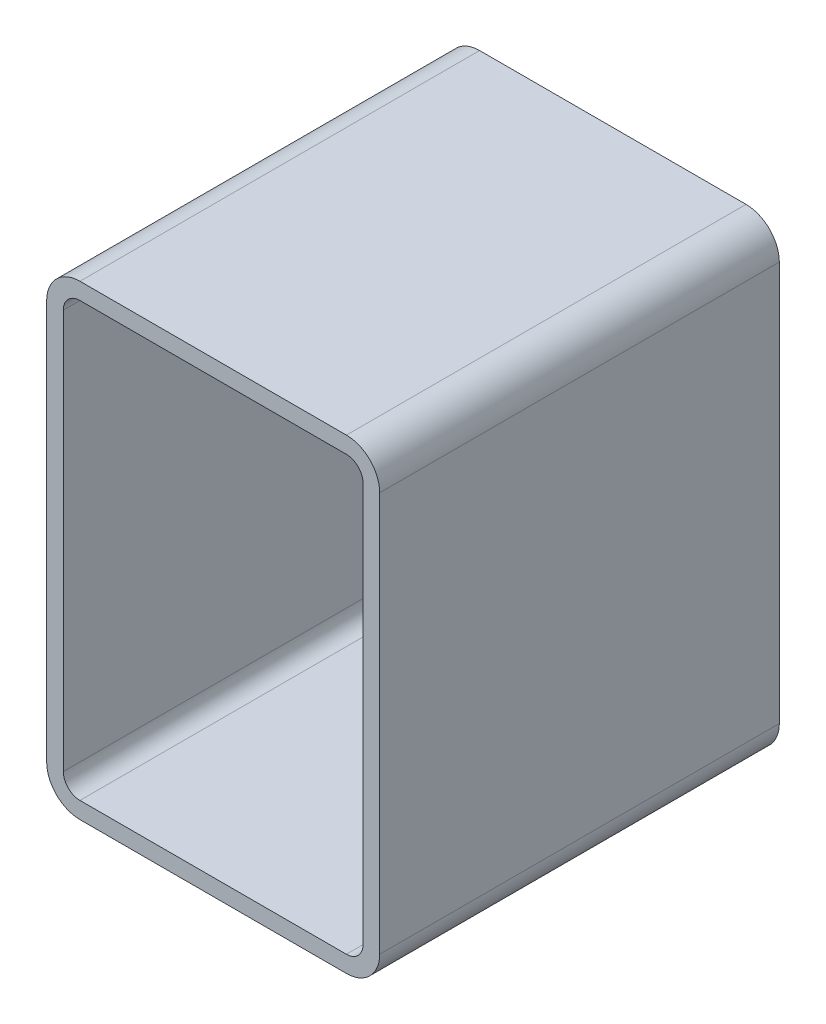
ISO-10303-21;
HEADER;
FILE_DESCRIPTION(('STEP AP214'),'2;1');
FILE_NAME('part.step','',(''),(''),'','','');
FILE_SCHEMA(('AUTOMOTIVE_DESIGN { 1 0 10303 214 1 1 1 1 }'));
ENDSEC;
DATA;
#1=APPLICATION_CONTEXT('core data for automotive mechanical design processes');
#2=APPLICATION_PROTOCOL_DEFINITION('international standard','automotive_design',2000,#1);
#3=PRODUCT_CONTEXT('',#1,'mechanical');
#4=PRODUCT('Part','Part','',(#3));
#5=PRODUCT_RELATED_PRODUCT_CATEGORY('part','',(#4));
#6=PRODUCT_DEFINITION_FORMATION('','',#4);
#7=PRODUCT_DEFINITION_CONTEXT('part definition',#1,'design');
#8=PRODUCT_DEFINITION('design','',#6,#7);
#9=PRODUCT_DEFINITION_SHAPE('','',#8);
#10=(LENGTH_UNIT() NAMED_UNIT(*) SI_UNIT(.MILLI.,.METRE.));
#11=(NAMED_UNIT(*) PLANE_ANGLE_UNIT() SI_UNIT($,.RADIAN.));
#12=(NAMED_UNIT(*) SI_UNIT($,.STERADIAN.) SOLID_ANGLE_UNIT());
#13=UNCERTAINTY_MEASURE_WITH_UNIT(LENGTH_MEASURE(1.E-05),#10,'distance_accuracy_value','');
#14=(GEOMETRIC_REPRESENTATION_CONTEXT(3) GLOBAL_UNCERTAINTY_ASSIGNED_CONTEXT((#13)) GLOBAL_UNIT_ASSIGNED_CONTEXT((#10,
#11,#12)) REPRESENTATION_CONTEXT('',''));
#15=CARTESIAN_POINT('',(0.,0.,0.));
#16=DIRECTION('',(0.,0.,1.));
#17=DIRECTION('',(1.,0.,0.));
#18=AXIS2_PLACEMENT_3D('',#15,#16,#17);
#19=CARTESIAN_POINT('',(28.1345794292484,332.028679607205,304.8));
#20=DIRECTION('',(0.,0.,1.));
#21=DIRECTION('',(1.,0.,0.));
#22=AXIS2_PLACEMENT_3D('',#19,#20,#21);
#23=PLANE('',#22);
#24=CARTESIAN_POINT('',(28.1345794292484,332.028679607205,304.8));
#25=DIRECTION('',(0.,0.,1.));
#26=DIRECTION('',(1.,0.,0.));
#27=AXIS2_PLACEMENT_3D('',#24,#25,#26);
#28=CIRCLE('',#27,25.4);
#29=CARTESIAN_POINT('',(28.1345794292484,357.428679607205,304.8));
#30=VERTEX_POINT('',#29);
#31=CARTESIAN_POINT('',(2.73457942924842,332.028679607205,304.8));
#32=VERTEX_POINT('',#31);
#33=EDGE_CURVE('E211',#30,#32,#28,.T.);
#34=ORIENTED_EDGE('',*,*,#33,.T.);
#35=DIRECTION('',(0.,-1.,0.));
#36=VECTOR('',#35,1.);
#37=CARTESIAN_POINT('',(2.73457942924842,27.2286796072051,304.8));
#38=LINE('',#37,#36);
#39=CARTESIAN_POINT('',(2.73457942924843,27.2286796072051,304.8));
#40=VERTEX_POINT('',#39);
#41=EDGE_CURVE('E214',#32,#40,#38,.T.);
#42=ORIENTED_EDGE('',*,*,#41,.T.);
#43=CARTESIAN_POINT('',(28.1345794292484,27.2286796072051,304.8));
#44=DIRECTION('',(0.,0.,1.));
#45=DIRECTION('',(1.,0.,0.));
#46=AXIS2_PLACEMENT_3D('',#43,#44,#45);
#47=CIRCLE('',#46,25.4);
#48=CARTESIAN_POINT('',(28.1345794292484,1.82867960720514,304.8));
#49=VERTEX_POINT('',#48);
#50=EDGE_CURVE('E217',#40,#49,#47,.T.);
#51=ORIENTED_EDGE('',*,*,#50,.T.);
#52=DIRECTION('',(1.,0.,0.));
#53=VECTOR('',#52,1.);
#54=CARTESIAN_POINT('',(231.334579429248,1.82867960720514,304.8));
#55=LINE('',#54,#53);
#56=CARTESIAN_POINT('',(231.334579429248,1.82867960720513,304.8));
#57=VERTEX_POINT('',#56);
#58=EDGE_CURVE('E219',#49,#57,#55,.T.);
#59=ORIENTED_EDGE('',*,*,#58,.T.);
#60=CARTESIAN_POINT('',(231.334579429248,27.2286796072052,304.8));
#61=DIRECTION('',(0.,0.,1.));
#62=DIRECTION('',(1.,0.,0.));
#63=AXIS2_PLACEMENT_3D('',#60,#61,#62);
#64=CIRCLE('',#63,25.4);
#65=CARTESIAN_POINT('',(256.734579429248,27.2286796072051,304.8));
#66=VERTEX_POINT('',#65);
#67=EDGE_CURVE('E221',#57,#66,#64,.T.);
#68=ORIENTED_EDGE('',*,*,#67,.T.);
#69=DIRECTION('',(0.,1.,0.));
#70=VECTOR('',#69,1.);
#71=CARTESIAN_POINT('',(256.734579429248,332.028679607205,304.8));
#72=LINE('',#71,#70);
#73=CARTESIAN_POINT('',(256.734579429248,332.028679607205,304.8));
#74=VERTEX_POINT('',#73);
#75=EDGE_CURVE('E223',#66,#74,#72,.T.);
#76=ORIENTED_EDGE('',*,*,#75,.T.);
#77=CARTESIAN_POINT('',(231.334579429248,332.028679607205,304.8));
#78=DIRECTION('',(0.,0.,1.));
#79=DIRECTION('',(1.,0.,0.));
#80=AXIS2_PLACEMENT_3D('',#77,#78,#79);
#81=CIRCLE('',#80,25.4);
#82=CARTESIAN_POINT('',(231.334579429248,357.428679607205,304.8));
#83=VERTEX_POINT('',#82);
#84=EDGE_CURVE('E225',#74,#83,#81,.T.);
#85=ORIENTED_EDGE('',*,*,#84,.T.);
#86=DIRECTION('',(-1.,0.,0.));
#87=VECTOR('',#86,1.);
#88=CARTESIAN_POINT('',(28.1345794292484,357.428679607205,304.8));
#89=LINE('',#88,#87);
#90=EDGE_CURVE('E227',#83,#30,#89,.T.);
#91=ORIENTED_EDGE('',*,*,#90,.T.);
#92=EDGE_LOOP('',(#34,#42,#51,#59,#68,#76,#85,#91));
#93=FACE_BOUND('',#92,.T.);
#94=DIRECTION('',(0.,-1.,0.));
#95=VECTOR('',#94,1.);
#96=CARTESIAN_POINT('',(15.4345794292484,27.2286796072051,304.8));
#97=LINE('',#96,#95);
#98=CARTESIAN_POINT('',(15.4345794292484,332.028679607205,304.8));
#99=VERTEX_POINT('',#98);
#100=CARTESIAN_POINT('',(15.4345794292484,27.2286796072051,304.8));
#101=VERTEX_POINT('',#100);
#102=EDGE_CURVE('E154',#99,#101,#97,.T.);
#103=ORIENTED_EDGE('',*,*,#102,.F.);
#104=CARTESIAN_POINT('',(28.1345794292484,332.028679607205,304.8));
#105=DIRECTION('',(0.,0.,1.));
#106=DIRECTION('',(1.,0.,0.));
#107=AXIS2_PLACEMENT_3D('',#104,#105,#106);
#108=CIRCLE('',#107,12.7);
#109=CARTESIAN_POINT('',(28.1345794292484,344.728679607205,304.8));
#110=VERTEX_POINT('',#109);
#111=EDGE_CURVE('E146',#110,#99,#108,.T.);
#112=ORIENTED_EDGE('',*,*,#111,.F.);
#113=DIRECTION('',(-1.,0.,0.));
#114=VECTOR('',#113,1.);
#115=CARTESIAN_POINT('',(28.1345794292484,344.728679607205,304.8));
#116=LINE('',#115,#114);
#117=CARTESIAN_POINT('',(231.334579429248,344.728679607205,304.8));
#118=VERTEX_POINT('',#117);
#119=EDGE_CURVE('E179',#118,#110,#116,.T.);
#120=ORIENTED_EDGE('',*,*,#119,.F.);
#121=CARTESIAN_POINT('',(231.334579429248,332.028679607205,304.8));
#122=DIRECTION('',(0.,0.,1.));
#123=DIRECTION('',(1.,0.,0.));
#124=AXIS2_PLACEMENT_3D('',#121,#122,#123);
#125=CIRCLE('',#124,12.7);
#126=CARTESIAN_POINT('',(244.034579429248,332.028679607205,304.8));
#127=VERTEX_POINT('',#126);
#128=EDGE_CURVE('E177',#127,#118,#125,.T.);
#129=ORIENTED_EDGE('',*,*,#128,.F.);
#130=DIRECTION('',(0.,1.,0.));
#131=VECTOR('',#130,1.);
#132=CARTESIAN_POINT('',(244.034579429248,332.028679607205,304.8));
#133=LINE('',#132,#131);
#134=CARTESIAN_POINT('',(244.034579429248,27.2286796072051,304.8));
#135=VERTEX_POINT('',#134);
#136=EDGE_CURVE('E175',#135,#127,#133,.T.);
#137=ORIENTED_EDGE('',*,*,#136,.F.);
#138=CARTESIAN_POINT('',(231.334579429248,27.2286796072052,304.8));
#139=DIRECTION('',(0.,0.,1.));
#140=DIRECTION('',(1.,0.,0.));
#141=AXIS2_PLACEMENT_3D('',#138,#139,#140);
#142=CIRCLE('',#141,12.7);
#143=CARTESIAN_POINT('',(231.334579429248,14.5286796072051,304.8));
#144=VERTEX_POINT('',#143);
#145=EDGE_CURVE('E173',#144,#135,#142,.T.);
#146=ORIENTED_EDGE('',*,*,#145,.F.);
#147=DIRECTION('',(1.,0.,0.));
#148=VECTOR('',#147,1.);
#149=CARTESIAN_POINT('',(231.334579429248,14.5286796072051,304.8));
#150=LINE('',#149,#148);
#151=CARTESIAN_POINT('',(28.1345794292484,14.5286796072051,304.8));
#152=VERTEX_POINT('',#151);
#153=EDGE_CURVE('E169',#152,#144,#150,.T.);
#154=ORIENTED_EDGE('',*,*,#153,.F.);
#155=CARTESIAN_POINT('',(28.1345794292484,27.2286796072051,304.8));
#156=DIRECTION('',(0.,0.,1.));
#157=DIRECTION('',(1.,0.,0.));
#158=AXIS2_PLACEMENT_3D('',#155,#156,#157);
#159=CIRCLE('',#158,12.7);
#160=EDGE_CURVE('E167',#101,#152,#159,.T.);
#161=ORIENTED_EDGE('',*,*,#160,.F.);
#162=EDGE_LOOP('',(#103,#112,#120,#129,#137,#146,#154,#161));
#163=FACE_BOUND('',#162,.T.);
#164=ADVANCED_FACE('F33',(#93,#163),#23,.T.);
#165=CARTESIAN_POINT('',(28.1345794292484,332.028679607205,0.));
#166=DIRECTION('',(0.,0.,1.));
#167=DIRECTION('',(1.,0.,0.));
#168=AXIS2_PLACEMENT_3D('',#165,#166,#167);
#169=PLANE('',#168);
#170=CARTESIAN_POINT('',(28.1345794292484,332.028679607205,0.));
#171=DIRECTION('',(0.,0.,1.));
#172=DIRECTION('',(1.,0.,0.));
#173=AXIS2_PLACEMENT_3D('',#170,#171,#172);
#174=CIRCLE('',#173,25.4);
#175=CARTESIAN_POINT('',(28.1345794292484,357.428679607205,0.));
#176=VERTEX_POINT('',#175);
#177=CARTESIAN_POINT('',(2.73457942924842,332.028679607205,0.));
#178=VERTEX_POINT('',#177);
#179=EDGE_CURVE('E162',#176,#178,#174,.T.);
#180=ORIENTED_EDGE('',*,*,#179,.F.);
#181=DIRECTION('',(-1.,0.,0.));
#182=VECTOR('',#181,1.);
#183=CARTESIAN_POINT('',(28.1345794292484,357.428679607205,0.));
#184=LINE('',#183,#182);
#185=CARTESIAN_POINT('',(231.334579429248,357.428679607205,0.));
#186=VERTEX_POINT('',#185);
#187=EDGE_CURVE('E215',#186,#176,#184,.T.);
#188=ORIENTED_EDGE('',*,*,#187,.F.);
#189=CARTESIAN_POINT('',(231.334579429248,332.028679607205,0.));
#190=DIRECTION('',(0.,0.,1.));
#191=DIRECTION('',(1.,0.,0.));
#192=AXIS2_PLACEMENT_3D('',#189,#190,#191);
#193=CIRCLE('',#192,25.4);
#194=CARTESIAN_POINT('',(256.734579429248,332.028679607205,0.));
#195=VERTEX_POINT('',#194);
#196=EDGE_CURVE('E242',#195,#186,#193,.T.);
#197=ORIENTED_EDGE('',*,*,#196,.F.);
#198=DIRECTION('',(0.,1.,0.));
#199=VECTOR('',#198,1.);
#200=CARTESIAN_POINT('',(256.734579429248,332.028679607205,0.));
#201=LINE('',#200,#199);
#202=CARTESIAN_POINT('',(256.734579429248,27.2286796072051,0.));
#203=VERTEX_POINT('',#202);
#204=EDGE_CURVE('E240',#203,#195,#201,.T.);
#205=ORIENTED_EDGE('',*,*,#204,.F.);
#206=CARTESIAN_POINT('',(231.334579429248,27.2286796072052,0.));
#207=DIRECTION('',(0.,0.,1.));
#208=DIRECTION('',(1.,0.,0.));
#209=AXIS2_PLACEMENT_3D('',#206,#207,#208);
#210=CIRCLE('',#209,25.4);
#211=CARTESIAN_POINT('',(231.334579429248,1.82867960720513,0.));
#212=VERTEX_POINT('',#211);
#213=EDGE_CURVE('E238',#212,#203,#210,.T.);
#214=ORIENTED_EDGE('',*,*,#213,.F.);
#215=DIRECTION('',(1.,0.,0.));
#216=VECTOR('',#215,1.);
#217=CARTESIAN_POINT('',(231.334579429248,1.82867960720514,0.));
#218=LINE('',#217,#216);
#219=CARTESIAN_POINT('',(28.1345794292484,1.82867960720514,0.));
#220=VERTEX_POINT('',#219);
#221=EDGE_CURVE('E236',#220,#212,#218,.T.);
#222=ORIENTED_EDGE('',*,*,#221,.F.);
#223=CARTESIAN_POINT('',(28.1345794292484,27.2286796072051,0.));
#224=DIRECTION('',(0.,0.,1.));
#225=DIRECTION('',(1.,0.,0.));
#226=AXIS2_PLACEMENT_3D('',#223,#224,#225);
#227=CIRCLE('',#226,25.4);
#228=CARTESIAN_POINT('',(2.73457942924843,27.2286796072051,0.));
#229=VERTEX_POINT('',#228);
#230=EDGE_CURVE('E234',#229,#220,#227,.T.);
#231=ORIENTED_EDGE('',*,*,#230,.F.);
#232=DIRECTION('',(0.,-1.,0.));
#233=VECTOR('',#232,1.);
#234=CARTESIAN_POINT('',(2.73457942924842,27.2286796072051,0.));
#235=LINE('',#234,#233);
#236=EDGE_CURVE('E232',#178,#229,#235,.T.);
#237=ORIENTED_EDGE('',*,*,#236,.F.);
#238=EDGE_LOOP('',(#180,#188,#197,#205,#214,#222,#231,#237));
#239=FACE_BOUND('',#238,.T.);
#240=CARTESIAN_POINT('',(28.1345794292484,332.028679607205,0.));
#241=DIRECTION('',(0.,0.,1.));
#242=DIRECTION('',(1.,0.,0.));
#243=AXIS2_PLACEMENT_3D('',#240,#241,#242);
#244=CIRCLE('',#243,12.7);
#245=CARTESIAN_POINT('',(28.1345794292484,344.728679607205,0.));
#246=VERTEX_POINT('',#245);
#247=CARTESIAN_POINT('',(15.4345794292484,332.028679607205,0.));
#248=VERTEX_POINT('',#247);
#249=EDGE_CURVE('E56',#246,#248,#244,.T.);
#250=ORIENTED_EDGE('',*,*,#249,.T.);
#251=DIRECTION('',(0.,-1.,0.));
#252=VECTOR('',#251,1.);
#253=CARTESIAN_POINT('',(15.4345794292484,27.2286796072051,0.));
#254=LINE('',#253,#252);
#255=CARTESIAN_POINT('',(15.4345794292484,27.2286796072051,0.));
#256=VERTEX_POINT('',#255);
#257=EDGE_CURVE('E161',#248,#256,#254,.T.);
#258=ORIENTED_EDGE('',*,*,#257,.T.);
#259=CARTESIAN_POINT('',(28.1345794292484,27.2286796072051,0.));
#260=DIRECTION('',(0.,0.,1.));
#261=DIRECTION('',(1.,0.,0.));
#262=AXIS2_PLACEMENT_3D('',#259,#260,#261);
#263=CIRCLE('',#262,12.7);
#264=CARTESIAN_POINT('',(28.1345794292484,14.5286796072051,0.));
#265=VERTEX_POINT('',#264);
#266=EDGE_CURVE('E183',#256,#265,#263,.T.);
#267=ORIENTED_EDGE('',*,*,#266,.T.);
#268=DIRECTION('',(1.,0.,0.));
#269=VECTOR('',#268,1.);
#270=CARTESIAN_POINT('',(231.334579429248,14.5286796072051,0.));
#271=LINE('',#270,#269);
#272=CARTESIAN_POINT('',(231.334579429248,14.5286796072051,0.));
#273=VERTEX_POINT('',#272);
#274=EDGE_CURVE('E186',#265,#273,#271,.T.);
#275=ORIENTED_EDGE('',*,*,#274,.T.);
#276=CARTESIAN_POINT('',(231.334579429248,27.2286796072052,0.));
#277=DIRECTION('',(0.,0.,1.));
#278=DIRECTION('',(1.,0.,0.));
#279=AXIS2_PLACEMENT_3D('',#276,#277,#278);
#280=CIRCLE('',#279,12.7);
#281=CARTESIAN_POINT('',(244.034579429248,27.2286796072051,0.));
#282=VERTEX_POINT('',#281);
#283=EDGE_CURVE('E189',#273,#282,#280,.T.);
#284=ORIENTED_EDGE('',*,*,#283,.T.);
#285=DIRECTION('',(0.,1.,0.));
#286=VECTOR('',#285,1.);
#287=CARTESIAN_POINT('',(244.034579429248,332.028679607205,0.));
#288=LINE('',#287,#286);
#289=CARTESIAN_POINT('',(244.034579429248,332.028679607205,0.));
#290=VERTEX_POINT('',#289);
#291=EDGE_CURVE('E192',#282,#290,#288,.T.);
#292=ORIENTED_EDGE('',*,*,#291,.T.);
#293=CARTESIAN_POINT('',(231.334579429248,332.028679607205,0.));
#294=DIRECTION('',(0.,0.,1.));
#295=DIRECTION('',(1.,0.,0.));
#296=AXIS2_PLACEMENT_3D('',#293,#294,#295);
#297=CIRCLE('',#296,12.7);
#298=CARTESIAN_POINT('',(231.334579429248,344.728679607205,0.));
#299=VERTEX_POINT('',#298);
#300=EDGE_CURVE('E195',#290,#299,#297,.T.);
#301=ORIENTED_EDGE('',*,*,#300,.T.);
#302=DIRECTION('',(-1.,0.,0.));
#303=VECTOR('',#302,1.);
#304=CARTESIAN_POINT('',(28.1345794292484,344.728679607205,0.));
#305=LINE('',#304,#303);
#306=EDGE_CURVE('E155',#299,#246,#305,.T.);
#307=ORIENTED_EDGE('',*,*,#306,.T.);
#308=EDGE_LOOP('',(#250,#258,#267,#275,#284,#292,#301,#307));
#309=FACE_BOUND('',#308,.T.);
#310=ADVANCED_FACE('F272',(#239,#309),#169,.F.);
#311=CARTESIAN_POINT('',(28.1345794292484,332.028679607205,304.8));
#312=DIRECTION('',(0.,0.,-1.));
#313=DIRECTION('',(-1.,0.,0.));
#314=AXIS2_PLACEMENT_3D('',#311,#312,#313);
#315=CYLINDRICAL_SURFACE('',#314,25.4);
#316=ORIENTED_EDGE('',*,*,#179,.T.);
#317=DIRECTION('',(0.,0.,-1.));
#318=VECTOR('',#317,1.);
#319=CARTESIAN_POINT('',(2.73457942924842,332.028679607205,304.8));
#320=LINE('',#319,#318);
#321=EDGE_CURVE('E11',#32,#178,#320,.T.);
#322=ORIENTED_EDGE('',*,*,#321,.F.);
#323=ORIENTED_EDGE('',*,*,#33,.F.);
#324=DIRECTION('',(0.,0.,-1.));
#325=VECTOR('',#324,1.);
#326=CARTESIAN_POINT('',(28.1345794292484,357.428679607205,304.8));
#327=LINE('',#326,#325);
#328=EDGE_CURVE('E229',#30,#176,#327,.T.);
#329=ORIENTED_EDGE('',*,*,#328,.T.);
#330=EDGE_LOOP('',(#316,#322,#323,#329));
#331=FACE_BOUND('',#330,.T.);
#332=ADVANCED_FACE('F35',(#331),#315,.T.);
#333=CARTESIAN_POINT('',(2.73457942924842,27.2286796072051,304.8));
#334=DIRECTION('',(1.,0.,0.));
#335=DIRECTION('',(0.,0.,-1.));
#336=AXIS2_PLACEMENT_3D('',#333,#334,#335);
#337=PLANE('',#336);
#338=ORIENTED_EDGE('',*,*,#236,.T.);
#339=DIRECTION('',(0.,0.,-1.));
#340=VECTOR('',#339,1.);
#341=CARTESIAN_POINT('',(2.73457942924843,27.2286796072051,304.8));
#342=LINE('',#341,#340);
#343=EDGE_CURVE('E41',#40,#229,#342,.T.);
#344=ORIENTED_EDGE('',*,*,#343,.F.);
#345=ORIENTED_EDGE('',*,*,#41,.F.);
#346=ORIENTED_EDGE('',*,*,#321,.T.);
#347=EDGE_LOOP('',(#338,#344,#345,#346));
#348=FACE_BOUND('',#347,.T.);
#349=ADVANCED_FACE('F289',(#348),#337,.F.);
#350=CARTESIAN_POINT('',(28.1345794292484,27.2286796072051,304.8));
#351=DIRECTION('',(0.,0.,-1.));
#352=DIRECTION('',(-1.,0.,0.));
#353=AXIS2_PLACEMENT_3D('',#350,#351,#352);
#354=CYLINDRICAL_SURFACE('',#353,25.4);
#355=ORIENTED_EDGE('',*,*,#230,.T.);
#356=DIRECTION('',(0.,0.,-1.));
#357=VECTOR('',#356,1.);
#358=CARTESIAN_POINT('',(28.1345794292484,1.82867960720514,304.8));
#359=LINE('',#358,#357);
#360=EDGE_CURVE('E259',#49,#220,#359,.T.);
#361=ORIENTED_EDGE('',*,*,#360,.F.);
#362=ORIENTED_EDGE('',*,*,#50,.F.);
#363=ORIENTED_EDGE('',*,*,#343,.T.);
#364=EDGE_LOOP('',(#355,#361,#362,#363));
#365=FACE_BOUND('',#364,.T.);
#366=ADVANCED_FACE('F266',(#365),#354,.T.);
#367=CARTESIAN_POINT('',(231.334579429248,1.82867960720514,304.8));
#368=DIRECTION('',(0.,1.,0.));
#369=DIRECTION('',(0.,0.,1.));
#370=AXIS2_PLACEMENT_3D('',#367,#368,#369);
#371=PLANE('',#370);
#372=ORIENTED_EDGE('',*,*,#221,.T.);
#373=DIRECTION('',(0.,0.,-1.));
#374=VECTOR('',#373,1.);
#375=CARTESIAN_POINT('',(231.334579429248,1.82867960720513,304.8));
#376=LINE('',#375,#374);
#377=EDGE_CURVE('E256',#57,#212,#376,.T.);
#378=ORIENTED_EDGE('',*,*,#377,.F.);
#379=ORIENTED_EDGE('',*,*,#58,.F.);
#380=ORIENTED_EDGE('',*,*,#360,.T.);
#381=EDGE_LOOP('',(#372,#378,#379,#380));
#382=FACE_BOUND('',#381,.T.);
#383=ADVANCED_FACE('F278',(#382),#371,.F.);
#384=CARTESIAN_POINT('',(231.334579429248,27.2286796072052,304.8));
#385=DIRECTION('',(0.,0.,-1.));
#386=DIRECTION('',(-1.,0.,0.));
#387=AXIS2_PLACEMENT_3D('',#384,#385,#386);
#388=CYLINDRICAL_SURFACE('',#387,25.4);
#389=ORIENTED_EDGE('',*,*,#213,.T.);
#390=DIRECTION('',(0.,0.,-1.));
#391=VECTOR('',#390,1.);
#392=CARTESIAN_POINT('',(256.734579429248,27.2286796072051,304.8));
#393=LINE('',#392,#391);
#394=EDGE_CURVE('E253',#66,#203,#393,.T.);
#395=ORIENTED_EDGE('',*,*,#394,.F.);
#396=ORIENTED_EDGE('',*,*,#67,.F.);
#397=ORIENTED_EDGE('',*,*,#377,.T.);
#398=EDGE_LOOP('',(#389,#395,#396,#397));
#399=FACE_BOUND('',#398,.T.);
#400=ADVANCED_FACE('F282',(#399),#388,.T.);
#401=CARTESIAN_POINT('',(256.734579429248,332.028679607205,304.8));
#402=DIRECTION('',(-1.,0.,0.));
#403=DIRECTION('',(0.,0.,1.));
#404=AXIS2_PLACEMENT_3D('',#401,#402,#403);
#405=PLANE('',#404);
#406=ORIENTED_EDGE('',*,*,#204,.T.);
#407=DIRECTION('',(0.,0.,-1.));
#408=VECTOR('',#407,1.);
#409=CARTESIAN_POINT('',(256.734579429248,332.028679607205,304.8));
#410=LINE('',#409,#408);
#411=EDGE_CURVE('E250',#74,#195,#410,.T.);
#412=ORIENTED_EDGE('',*,*,#411,.F.);
#413=ORIENTED_EDGE('',*,*,#75,.F.);
#414=ORIENTED_EDGE('',*,*,#394,.T.);
#415=EDGE_LOOP('',(#406,#412,#413,#414));
#416=FACE_BOUND('',#415,.T.);
#417=ADVANCED_FACE('F302',(#416),#405,.F.);
#418=CARTESIAN_POINT('',(231.334579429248,332.028679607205,304.8));
#419=DIRECTION('',(0.,0.,-1.));
#420=DIRECTION('',(-1.,0.,0.));
#421=AXIS2_PLACEMENT_3D('',#418,#419,#420);
#422=CYLINDRICAL_SURFACE('',#421,25.4);
#423=ORIENTED_EDGE('',*,*,#196,.T.);
#424=DIRECTION('',(0.,0.,-1.));
#425=VECTOR('',#424,1.);
#426=CARTESIAN_POINT('',(231.334579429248,357.428679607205,304.8));
#427=LINE('',#426,#425);
#428=EDGE_CURVE('E247',#83,#186,#427,.T.);
#429=ORIENTED_EDGE('',*,*,#428,.F.);
#430=ORIENTED_EDGE('',*,*,#84,.F.);
#431=ORIENTED_EDGE('',*,*,#411,.T.);
#432=EDGE_LOOP('',(#423,#429,#430,#431));
#433=FACE_BOUND('',#432,.T.);
#434=ADVANCED_FACE('F300',(#433),#422,.T.);
#435=CARTESIAN_POINT('',(28.1345794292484,357.428679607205,304.8));
#436=DIRECTION('',(0.,-1.,0.));
#437=DIRECTION('',(0.,0.,-1.));
#438=AXIS2_PLACEMENT_3D('',#435,#436,#437);
#439=PLANE('',#438);
#440=ORIENTED_EDGE('',*,*,#187,.T.);
#441=ORIENTED_EDGE('',*,*,#328,.F.);
#442=ORIENTED_EDGE('',*,*,#90,.F.);
#443=ORIENTED_EDGE('',*,*,#428,.T.);
#444=EDGE_LOOP('',(#440,#441,#442,#443));
#445=FACE_BOUND('',#444,.T.);
#446=ADVANCED_FACE('F295',(#445),#439,.F.);
#447=CARTESIAN_POINT('',(28.1345794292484,332.028679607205,304.8));
#448=DIRECTION('',(0.,0.,-1.));
#449=DIRECTION('',(-1.,0.,0.));
#450=AXIS2_PLACEMENT_3D('',#447,#448,#449);
#451=CYLINDRICAL_SURFACE('',#450,12.7);
#452=ORIENTED_EDGE('',*,*,#249,.F.);
#453=DIRECTION('',(0.,0.,-1.));
#454=VECTOR('',#453,1.);
#455=CARTESIAN_POINT('',(28.1345794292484,344.728679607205,304.8));
#456=LINE('',#455,#454);
#457=EDGE_CURVE('E150',#110,#246,#456,.T.);
#458=ORIENTED_EDGE('',*,*,#457,.F.);
#459=ORIENTED_EDGE('',*,*,#111,.T.);
#460=DIRECTION('',(0.,0.,-1.));
#461=VECTOR('',#460,1.);
#462=CARTESIAN_POINT('',(15.4345794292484,332.028679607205,304.8));
#463=LINE('',#462,#461);
#464=EDGE_CURVE('E149',#99,#248,#463,.T.);
#465=ORIENTED_EDGE('',*,*,#464,.T.);
#466=EDGE_LOOP('',(#452,#458,#459,#465));
#467=FACE_BOUND('',#466,.T.);
#468=ADVANCED_FACE('F148',(#467),#451,.F.);
#469=CARTESIAN_POINT('',(15.4345794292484,27.2286796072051,304.8));
#470=DIRECTION('',(1.,0.,0.));
#471=DIRECTION('',(0.,0.,-1.));
#472=AXIS2_PLACEMENT_3D('',#469,#470,#471);
#473=PLANE('',#472);
#474=ORIENTED_EDGE('',*,*,#257,.F.);
#475=ORIENTED_EDGE('',*,*,#464,.F.);
#476=ORIENTED_EDGE('',*,*,#102,.T.);
#477=DIRECTION('',(0.,0.,-1.));
#478=VECTOR('',#477,1.);
#479=CARTESIAN_POINT('',(15.4345794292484,27.2286796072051,304.8));
#480=LINE('',#479,#478);
#481=EDGE_CURVE('E163',#101,#256,#480,.T.);
#482=ORIENTED_EDGE('',*,*,#481,.T.);
#483=EDGE_LOOP('',(#474,#475,#476,#482));
#484=FACE_BOUND('',#483,.T.);
#485=ADVANCED_FACE('F158',(#484),#473,.T.);
#486=CARTESIAN_POINT('',(28.1345794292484,27.2286796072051,304.8));
#487=DIRECTION('',(0.,0.,-1.));
#488=DIRECTION('',(-1.,0.,0.));
#489=AXIS2_PLACEMENT_3D('',#486,#487,#488);
#490=CYLINDRICAL_SURFACE('',#489,12.7);
#491=ORIENTED_EDGE('',*,*,#266,.F.);
#492=ORIENTED_EDGE('',*,*,#481,.F.);
#493=ORIENTED_EDGE('',*,*,#160,.T.);
#494=DIRECTION('',(0.,0.,-1.));
#495=VECTOR('',#494,1.);
#496=CARTESIAN_POINT('',(28.1345794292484,14.5286796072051,304.8));
#497=LINE('',#496,#495);
#498=EDGE_CURVE('E208',#152,#265,#497,.T.);
#499=ORIENTED_EDGE('',*,*,#498,.T.);
#500=EDGE_LOOP('',(#491,#492,#493,#499));
#501=FACE_BOUND('',#500,.T.);
#502=ADVANCED_FACE('F327',(#501),#490,.F.);
#503=CARTESIAN_POINT('',(231.334579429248,14.5286796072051,304.8));
#504=DIRECTION('',(0.,1.,0.));
#505=DIRECTION('',(0.,0.,1.));
#506=AXIS2_PLACEMENT_3D('',#503,#504,#505);
#507=PLANE('',#506);
#508=ORIENTED_EDGE('',*,*,#274,.F.);
#509=ORIENTED_EDGE('',*,*,#498,.F.);
#510=ORIENTED_EDGE('',*,*,#153,.T.);
#511=DIRECTION('',(0.,0.,-1.));
#512=VECTOR('',#511,1.);
#513=CARTESIAN_POINT('',(231.334579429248,14.5286796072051,304.8));
#514=LINE('',#513,#512);
#515=EDGE_CURVE('E206',#144,#273,#514,.T.);
#516=ORIENTED_EDGE('',*,*,#515,.T.);
#517=EDGE_LOOP('',(#508,#509,#510,#516));
#518=FACE_BOUND('',#517,.T.);
#519=ADVANCED_FACE('F331',(#518),#507,.T.);
#520=CARTESIAN_POINT('',(231.334579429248,27.2286796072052,304.8));
#521=DIRECTION('',(0.,0.,-1.));
#522=DIRECTION('',(-1.,0.,0.));
#523=AXIS2_PLACEMENT_3D('',#520,#521,#522);
#524=CYLINDRICAL_SURFACE('',#523,12.7);
#525=ORIENTED_EDGE('',*,*,#283,.F.);
#526=ORIENTED_EDGE('',*,*,#515,.F.);
#527=ORIENTED_EDGE('',*,*,#145,.T.);
#528=DIRECTION('',(0.,0.,-1.));
#529=VECTOR('',#528,1.);
#530=CARTESIAN_POINT('',(244.034579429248,27.2286796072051,304.8));
#531=LINE('',#530,#529);
#532=EDGE_CURVE('E204',#135,#282,#531,.T.);
#533=ORIENTED_EDGE('',*,*,#532,.T.);
#534=EDGE_LOOP('',(#525,#526,#527,#533));
#535=FACE_BOUND('',#534,.T.);
#536=ADVANCED_FACE('F337',(#535),#524,.F.);
#537=CARTESIAN_POINT('',(244.034579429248,332.028679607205,304.8));
#538=DIRECTION('',(-1.,0.,0.));
#539=DIRECTION('',(0.,0.,1.));
#540=AXIS2_PLACEMENT_3D('',#537,#538,#539);
#541=PLANE('',#540);
#542=ORIENTED_EDGE('',*,*,#291,.F.);
#543=ORIENTED_EDGE('',*,*,#532,.F.);
#544=ORIENTED_EDGE('',*,*,#136,.T.);
#545=DIRECTION('',(0.,0.,-1.));
#546=VECTOR('',#545,1.);
#547=CARTESIAN_POINT('',(244.034579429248,332.028679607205,304.8));
#548=LINE('',#547,#546);
#549=EDGE_CURVE('E202',#127,#290,#548,.T.);
#550=ORIENTED_EDGE('',*,*,#549,.T.);
#551=EDGE_LOOP('',(#542,#543,#544,#550));
#552=FACE_BOUND('',#551,.T.);
#553=ADVANCED_FACE('F341',(#552),#541,.T.);
#554=CARTESIAN_POINT('',(231.334579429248,332.028679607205,304.8));
#555=DIRECTION('',(0.,0.,-1.));
#556=DIRECTION('',(-1.,0.,0.));
#557=AXIS2_PLACEMENT_3D('',#554,#555,#556);
#558=CYLINDRICAL_SURFACE('',#557,12.7);
#559=ORIENTED_EDGE('',*,*,#300,.F.);
#560=ORIENTED_EDGE('',*,*,#549,.F.);
#561=ORIENTED_EDGE('',*,*,#128,.T.);
#562=DIRECTION('',(0.,0.,-1.));
#563=VECTOR('',#562,1.);
#564=CARTESIAN_POINT('',(231.334579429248,344.728679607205,304.8));
#565=LINE('',#564,#563);
#566=EDGE_CURVE('E48',#118,#299,#565,.T.);
#567=ORIENTED_EDGE('',*,*,#566,.T.);
#568=EDGE_LOOP('',(#559,#560,#561,#567));
#569=FACE_BOUND('',#568,.T.);
#570=ADVANCED_FACE('F345',(#569),#558,.F.);
#571=CARTESIAN_POINT('',(28.1345794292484,344.728679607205,304.8));
#572=DIRECTION('',(0.,-1.,0.));
#573=DIRECTION('',(0.,0.,-1.));
#574=AXIS2_PLACEMENT_3D('',#571,#572,#573);
#575=PLANE('',#574);
#576=ORIENTED_EDGE('',*,*,#306,.F.);
#577=ORIENTED_EDGE('',*,*,#566,.F.);
#578=ORIENTED_EDGE('',*,*,#119,.T.);
#579=ORIENTED_EDGE('',*,*,#457,.T.);
#580=EDGE_LOOP('',(#576,#577,#578,#579));
#581=FACE_BOUND('',#580,.T.);
#582=ADVANCED_FACE('F349',(#581),#575,.T.);
#583=CLOSED_SHELL('',(#164,#310,#332,#349,#366,#383,#400,#417,#434,#446,#468,#485,#502,#519,
#536,#553,#570,#582));
#584=MANIFOLD_SOLID_BREP('B2',#583);
#585=ADVANCED_BREP_SHAPE_REPRESENTATION('',(#18,#584),#14);
#586=SHAPE_DEFINITION_REPRESENTATION(#9,#585);
ENDSEC;
END-ISO-10303-21;
